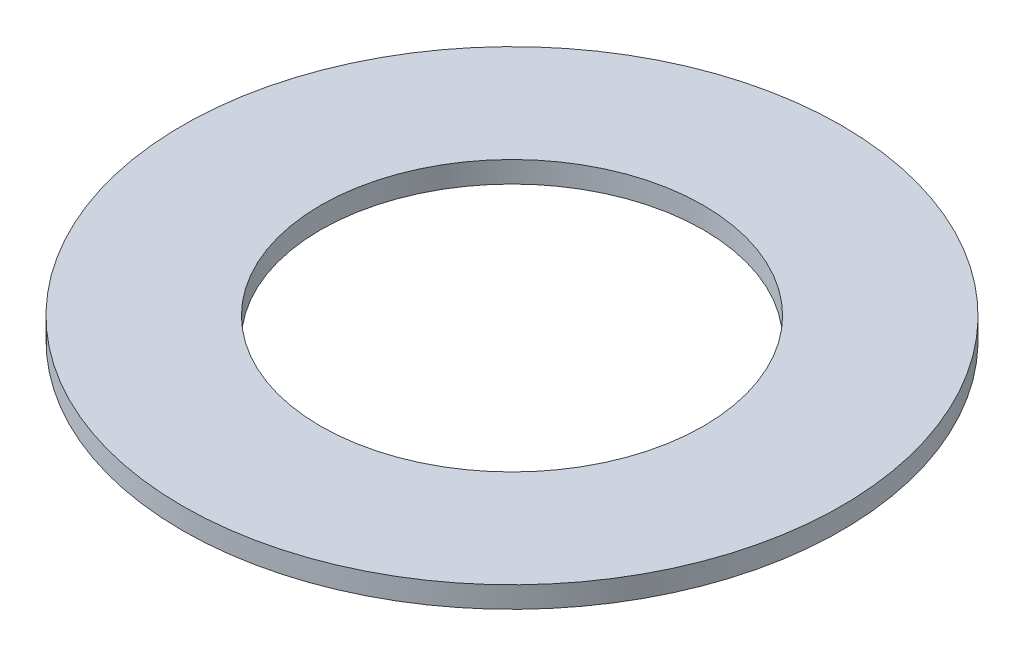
ISO-10303-21;
HEADER;
FILE_DESCRIPTION(('STEP AP214'),'2;1');
FILE_NAME('part.step','',(''),(''),'','','');
FILE_SCHEMA(('AUTOMOTIVE_DESIGN { 1 0 10303 214 1 1 1 1 }'));
ENDSEC;
DATA;
#1=APPLICATION_CONTEXT('core data for automotive mechanical design processes');
#2=APPLICATION_PROTOCOL_DEFINITION('international standard','automotive_design',2000,#1);
#3=PRODUCT_CONTEXT('',#1,'mechanical');
#4=PRODUCT('Part','Part','',(#3));
#5=PRODUCT_RELATED_PRODUCT_CATEGORY('part','',(#4));
#6=PRODUCT_DEFINITION_FORMATION('','',#4);
#7=PRODUCT_DEFINITION_CONTEXT('part definition',#1,'design');
#8=PRODUCT_DEFINITION('design','',#6,#7);
#9=PRODUCT_DEFINITION_SHAPE('','',#8);
#10=(LENGTH_UNIT() NAMED_UNIT(*) SI_UNIT(.MILLI.,.METRE.));
#11=(NAMED_UNIT(*) PLANE_ANGLE_UNIT() SI_UNIT($,.RADIAN.));
#12=(NAMED_UNIT(*) SI_UNIT($,.STERADIAN.) SOLID_ANGLE_UNIT());
#13=UNCERTAINTY_MEASURE_WITH_UNIT(LENGTH_MEASURE(1.E-05),#10,'distance_accuracy_value','');
#14=(GEOMETRIC_REPRESENTATION_CONTEXT(3) GLOBAL_UNCERTAINTY_ASSIGNED_CONTEXT((#13)) GLOBAL_UNIT_ASSIGNED_CONTEXT((#10,
#11,#12)) REPRESENTATION_CONTEXT('',''));
#15=CARTESIAN_POINT('',(0.,0.,0.));
#16=DIRECTION('',(0.,0.,1.));
#17=DIRECTION('',(1.,0.,0.));
#18=AXIS2_PLACEMENT_3D('',#15,#16,#17);
#19=CARTESIAN_POINT('',(8.88178419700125E-13,14.8699013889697,-4.44089209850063E-13));
#20=DIRECTION('',(0.,0.999999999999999,0.));
#21=DIRECTION('',(0.,0.,1.));
#22=AXIS2_PLACEMENT_3D('',#19,#20,#21);
#23=CYLINDRICAL_SURFACE('',#22,2.286);
#24=CARTESIAN_POINT('',(-1.77635683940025E-12,-0.127000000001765,8.88178419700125E-13));
#25=DIRECTION('',(0.,0.999999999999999,0.));
#26=DIRECTION('',(0.,0.,1.));
#27=AXIS2_PLACEMENT_3D('',#24,#25,#26);
#28=CIRCLE('',#27,2.286);
#29=CARTESIAN_POINT('',(8.77259703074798E-13,-0.127000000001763,2.28599999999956));
#30=VERTEX_POINT('',#29);
#31=EDGE_CURVE('E10',#30,#30,#28,.T.);
#32=CARTESIAN_POINT('',(8.88178419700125E-13,0.127000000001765,-8.88178419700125E-13));
#33=DIRECTION('',(0.,0.999999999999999,0.));
#34=DIRECTION('',(0.,0.,1.));
#35=AXIS2_PLACEMENT_3D('',#32,#33,#34);
#36=CIRCLE('',#35,2.286);
#37=CARTESIAN_POINT('',(8.77386601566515E-13,0.127000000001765,2.28599999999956));
#38=VERTEX_POINT('',#37);
#39=EDGE_CURVE('E46',#38,#38,#36,.T.);
#40=CARTESIAN_POINT('',(8.77259703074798E-13,-0.127000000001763,2.28599999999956));
#41=CARTESIAN_POINT('',(8.77261024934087E-13,-0.124354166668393,2.28599999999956));
#42=CARTESIAN_POINT('',(8.77262346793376E-13,-0.121708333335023,2.28599999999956));
#43=CARTESIAN_POINT('',(8.77264990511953E-13,-0.116416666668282,2.28599999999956));
#44=CARTESIAN_POINT('',(8.77266312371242E-13,-0.113770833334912,2.28599999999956));
#45=CARTESIAN_POINT('',(8.77268956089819E-13,-0.108479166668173,2.28599999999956));
#46=CARTESIAN_POINT('',(8.77270277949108E-13,-0.105833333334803,2.28599999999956));
#47=CARTESIAN_POINT('',(8.77272921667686E-13,-0.100541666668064,2.28599999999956));
#48=CARTESIAN_POINT('',(8.77274243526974E-13,-0.0978958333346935,2.28599999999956));
#49=CARTESIAN_POINT('',(8.77276887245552E-13,-0.0926041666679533,2.28599999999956));
#50=CARTESIAN_POINT('',(8.7727820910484E-13,-0.0899583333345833,2.28599999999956));
#51=CARTESIAN_POINT('',(8.77280852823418E-13,-0.0846666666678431,2.28599999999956));
#52=CARTESIAN_POINT('',(8.77282174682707E-13,-0.082020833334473,2.28599999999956));
#53=CARTESIAN_POINT('',(8.77284818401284E-13,-0.0767291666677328,2.28599999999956));
#54=CARTESIAN_POINT('',(8.77286140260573E-13,-0.0740833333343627,2.28599999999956));
#55=CARTESIAN_POINT('',(8.7728878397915E-13,-0.0687916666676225,2.28599999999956));
#56=CARTESIAN_POINT('',(8.77290105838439E-13,-0.0661458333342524,2.28599999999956));
#57=CARTESIAN_POINT('',(8.77292749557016E-13,-0.0608541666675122,2.28599999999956));
#58=CARTESIAN_POINT('',(8.77294071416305E-13,-0.0582083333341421,2.28599999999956));
#59=CARTESIAN_POINT('',(8.77296715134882E-13,-0.0529166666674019,2.28599999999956));
#60=CARTESIAN_POINT('',(8.77298036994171E-13,-0.0502708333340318,2.28599999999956));
#61=CARTESIAN_POINT('',(8.77300680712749E-13,-0.0449791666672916,2.28599999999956));
#62=CARTESIAN_POINT('',(8.77302002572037E-13,-0.0423333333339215,2.28599999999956));
#63=CARTESIAN_POINT('',(8.77304646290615E-13,-0.0370416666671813,2.28599999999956));
#64=CARTESIAN_POINT('',(8.77305968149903E-13,-0.0343958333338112,2.28599999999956));
#65=CARTESIAN_POINT('',(8.77308611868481E-13,-0.0291041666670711,2.28599999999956));
#66=CARTESIAN_POINT('',(8.7730993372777E-13,-0.026458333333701,2.28599999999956));
#67=CARTESIAN_POINT('',(8.77312577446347E-13,-0.0211666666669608,2.28599999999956));
#68=CARTESIAN_POINT('',(8.77313899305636E-13,-0.0185208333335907,2.28599999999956));
#69=CARTESIAN_POINT('',(8.77316543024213E-13,-0.0132291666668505,2.28599999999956));
#70=CARTESIAN_POINT('',(8.77317864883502E-13,-0.0105833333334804,2.28599999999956));
#71=CARTESIAN_POINT('',(8.77320508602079E-13,-0.00529166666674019,2.28599999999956));
#72=CARTESIAN_POINT('',(8.77321830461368E-13,-0.0026458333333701,2.28599999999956));
#73=CARTESIAN_POINT('',(8.77324474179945E-13,0.0026458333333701,2.28599999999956));
#74=CARTESIAN_POINT('',(8.77325796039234E-13,0.00529166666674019,2.28599999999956));
#75=CARTESIAN_POINT('',(8.77328439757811E-13,0.0105833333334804,2.28599999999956));
#76=CARTESIAN_POINT('',(8.773297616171E-13,0.0132291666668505,2.28599999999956));
#77=CARTESIAN_POINT('',(8.77332405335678E-13,0.0185208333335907,2.28599999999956));
#78=CARTESIAN_POINT('',(8.77333727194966E-13,0.0211666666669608,2.28599999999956));
#79=CARTESIAN_POINT('',(8.77336370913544E-13,0.026458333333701,2.28599999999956));
#80=CARTESIAN_POINT('',(8.77337692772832E-13,0.0291041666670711,2.28599999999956));
#81=CARTESIAN_POINT('',(8.7734033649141E-13,0.0343958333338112,2.28599999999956));
#82=CARTESIAN_POINT('',(8.77341658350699E-13,0.0370416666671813,2.28599999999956));
#83=CARTESIAN_POINT('',(8.77344302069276E-13,0.0423333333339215,2.28599999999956));
#84=CARTESIAN_POINT('',(8.77345623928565E-13,0.0449791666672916,2.28599999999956));
#85=CARTESIAN_POINT('',(8.77348267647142E-13,0.0502708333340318,2.28599999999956));
#86=CARTESIAN_POINT('',(8.77349589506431E-13,0.0529166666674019,2.28599999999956));
#87=CARTESIAN_POINT('',(8.77352233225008E-13,0.0582083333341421,2.28599999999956));
#88=CARTESIAN_POINT('',(8.77353555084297E-13,0.0608541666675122,2.28599999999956));
#89=CARTESIAN_POINT('',(8.77356198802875E-13,0.0661458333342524,2.28599999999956));
#90=CARTESIAN_POINT('',(8.77357520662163E-13,0.0687916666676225,2.28599999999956));
#91=CARTESIAN_POINT('',(8.77360164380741E-13,0.0740833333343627,2.28599999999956));
#92=CARTESIAN_POINT('',(8.77361486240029E-13,0.0767291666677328,2.28599999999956));
#93=CARTESIAN_POINT('',(8.77364129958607E-13,0.082020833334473,2.28599999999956));
#94=CARTESIAN_POINT('',(8.77365451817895E-13,0.0846666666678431,2.28599999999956));
#95=CARTESIAN_POINT('',(8.77368095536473E-13,0.0899583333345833,2.28599999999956));
#96=CARTESIAN_POINT('',(8.77369417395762E-13,0.0926041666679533,2.28599999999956));
#97=CARTESIAN_POINT('',(8.77372061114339E-13,0.0978958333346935,2.28599999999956));
#98=CARTESIAN_POINT('',(8.77373382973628E-13,0.100541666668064,2.28599999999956));
#99=CARTESIAN_POINT('',(8.77376026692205E-13,0.105833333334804,2.28599999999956));
#100=CARTESIAN_POINT('',(8.77377348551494E-13,0.108479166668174,2.28599999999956));
#101=CARTESIAN_POINT('',(8.77379992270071E-13,0.113770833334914,2.28599999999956));
#102=CARTESIAN_POINT('',(8.7738131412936E-13,0.116416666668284,2.28599999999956));
#103=CARTESIAN_POINT('',(8.77383957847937E-13,0.121708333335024,2.28599999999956));
#104=CARTESIAN_POINT('',(8.77385279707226E-13,0.124354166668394,2.28599999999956));
#105=CARTESIAN_POINT('',(8.77386601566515E-13,0.127000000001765,2.28599999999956));
#106=B_SPLINE_CURVE_WITH_KNOTS('',3,(#40,#41,#42,#43,#44,#45,#46,#47,#48,#49,#50,#51,#52,#53,
#54,#55,#56,#57,#58,#59,#60,#61,#62,#63,#64,#65,#66,#67,#68,#69,#70,#71,#72,#73,#74,#75,#76,#77,
#78,#79,#80,#81,#82,#83,#84,#85,#86,#87,#88,#89,#90,#91,#92,#93,#94,#95,#96,#97,#98,#99,#100,
#101,#102,#103,#104,#105),.UNSPECIFIED.,.F.,.F.,(4,2,2,2,2,2,2,2,2,2,2,2,2,2,2,2,2,2,2,2,2,2,2,
2,2,2,2,2,2,2,2,2,4),(0.,0.00793750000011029,0.0158750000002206,0.0238125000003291,
0.0317500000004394,0.0396875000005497,0.04762500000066,0.0555625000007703,0.0635000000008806,
0.0714375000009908,0.0793750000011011,0.0873125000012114,0.0952500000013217,0.103187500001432,
0.111125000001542,0.119062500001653,0.127000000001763,0.134937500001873,0.142875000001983,
0.150812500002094,0.158750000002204,0.166687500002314,0.174625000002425,0.182562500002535,
0.190500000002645,0.198437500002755,0.206375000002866,0.214312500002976,0.222250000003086,
0.230187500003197,0.238125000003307,0.246062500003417,0.254000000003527),.UNSPECIFIED.);
#107=EDGE_CURVE('BSEAM32',#30,#38,#106,.T.);
#108=ORIENTED_EDGE('',*,*,#31,.F.);
#109=ORIENTED_EDGE('',*,*,#39,.T.);
#110=ORIENTED_EDGE('',*,*,#107,.T.);
#111=ORIENTED_EDGE('',*,*,#107,.F.);
#112=EDGE_LOOP('',(#108,#110,#109,#111));
#113=FACE_BOUND('',#112,.T.);
#114=ADVANCED_FACE('F32',(#113),#23,.F.);
#115=CARTESIAN_POINT('',(2.66453525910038E-12,-0.1269999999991,-3.93700000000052));
#116=DIRECTION('',(0.,0.999999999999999,0.));
#117=DIRECTION('',(0.,0.,1.));
#118=AXIS2_PLACEMENT_3D('',#115,#116,#117);
#119=PLANE('',#118);
#120=CARTESIAN_POINT('',(-1.77635683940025E-12,-0.127000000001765,8.88178419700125E-13));
#121=DIRECTION('',(0.,0.999999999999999,0.));
#122=DIRECTION('',(0.,0.,1.));
#123=AXIS2_PLACEMENT_3D('',#120,#121,#122);
#124=CIRCLE('',#123,3.937);
#125=CARTESIAN_POINT('',(8.74785182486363E-13,-0.127000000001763,3.93699999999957));
#126=VERTEX_POINT('',#125);
#127=EDGE_CURVE('E38',#126,#126,#124,.T.);
#128=ORIENTED_EDGE('',*,*,#127,.F.);
#129=EDGE_LOOP('',(#128));
#130=FACE_BOUND('',#129,.T.);
#131=ORIENTED_EDGE('',*,*,#31,.T.);
#132=EDGE_LOOP('',(#131));
#133=FACE_BOUND('',#132,.T.);
#134=ADVANCED_FACE('F61',(#130,#133),#119,.F.);
#135=CARTESIAN_POINT('',(8.88178419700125E-13,14.8699013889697,-4.44089209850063E-13));
#136=DIRECTION('',(0.,0.999999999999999,0.));
#137=DIRECTION('',(0.,0.,1.));
#138=AXIS2_PLACEMENT_3D('',#135,#136,#137);
#139=CYLINDRICAL_SURFACE('',#138,3.937);
#140=CARTESIAN_POINT('',(8.88178419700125E-13,0.127000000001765,-8.88178419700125E-13));
#141=DIRECTION('',(0.,0.999999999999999,0.));
#142=DIRECTION('',(0.,0.,1.));
#143=AXIS2_PLACEMENT_3D('',#140,#141,#142);
#144=CIRCLE('',#143,3.937);
#145=CARTESIAN_POINT('',(8.74912080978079E-13,0.127000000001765,3.93699999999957));
#146=VERTEX_POINT('',#145);
#147=EDGE_CURVE('E42',#146,#146,#144,.T.);
#148=CARTESIAN_POINT('',(8.74912080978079E-13,0.127000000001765,3.93699999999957));
#149=CARTESIAN_POINT('',(8.7491075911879E-13,0.124354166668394,3.93699999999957));
#150=CARTESIAN_POINT('',(8.74909437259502E-13,0.121708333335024,3.93699999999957));
#151=CARTESIAN_POINT('',(8.74906793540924E-13,0.116416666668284,3.93699999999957));
#152=CARTESIAN_POINT('',(8.74905471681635E-13,0.113770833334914,3.93699999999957));
#153=CARTESIAN_POINT('',(8.74902827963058E-13,0.108479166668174,3.93699999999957));
#154=CARTESIAN_POINT('',(8.74901506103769E-13,0.105833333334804,3.93699999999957));
#155=CARTESIAN_POINT('',(8.74898862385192E-13,0.100541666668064,3.93699999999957));
#156=CARTESIAN_POINT('',(8.74897540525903E-13,0.0978958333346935,3.93699999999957));
#157=CARTESIAN_POINT('',(8.74894896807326E-13,0.0926041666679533,3.93699999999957));
#158=CARTESIAN_POINT('',(8.74893574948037E-13,0.0899583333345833,3.93699999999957));
#159=CARTESIAN_POINT('',(8.7489093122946E-13,0.0846666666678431,3.93699999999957));
#160=CARTESIAN_POINT('',(8.74889609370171E-13,0.082020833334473,3.93699999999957));
#161=CARTESIAN_POINT('',(8.74886965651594E-13,0.0767291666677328,3.93699999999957));
#162=CARTESIAN_POINT('',(8.74885643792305E-13,0.0740833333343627,3.93699999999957));
#163=CARTESIAN_POINT('',(8.74883000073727E-13,0.0687916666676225,3.93699999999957));
#164=CARTESIAN_POINT('',(8.74881678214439E-13,0.0661458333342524,3.93699999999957));
#165=CARTESIAN_POINT('',(8.74879034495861E-13,0.0608541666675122,3.93699999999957));
#166=CARTESIAN_POINT('',(8.74877712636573E-13,0.0582083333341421,3.93699999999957));
#167=CARTESIAN_POINT('',(8.74875068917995E-13,0.0529166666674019,3.93699999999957));
#168=CARTESIAN_POINT('',(8.74873747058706E-13,0.0502708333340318,3.93699999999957));
#169=CARTESIAN_POINT('',(8.74871103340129E-13,0.0449791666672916,3.93699999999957));
#170=CARTESIAN_POINT('',(8.7486978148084E-13,0.0423333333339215,3.93699999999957));
#171=CARTESIAN_POINT('',(8.74867137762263E-13,0.0370416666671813,3.93699999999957));
#172=CARTESIAN_POINT('',(8.74865815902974E-13,0.0343958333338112,3.93699999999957));
#173=CARTESIAN_POINT('',(8.74863172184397E-13,0.0291041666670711,3.93699999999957));
#174=CARTESIAN_POINT('',(8.74861850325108E-13,0.026458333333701,3.93699999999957));
#175=CARTESIAN_POINT('',(8.74859206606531E-13,0.0211666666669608,3.93699999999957));
#176=CARTESIAN_POINT('',(8.74857884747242E-13,0.0185208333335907,3.93699999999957));
#177=CARTESIAN_POINT('',(8.74855241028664E-13,0.0132291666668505,3.93699999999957));
#178=CARTESIAN_POINT('',(8.74853919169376E-13,0.0105833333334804,3.93699999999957));
#179=CARTESIAN_POINT('',(8.74851275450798E-13,0.00529166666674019,3.93699999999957));
#180=CARTESIAN_POINT('',(8.7484995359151E-13,0.0026458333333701,3.93699999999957));
#181=CARTESIAN_POINT('',(8.74847309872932E-13,-0.0026458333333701,3.93699999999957));
#182=CARTESIAN_POINT('',(8.74845988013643E-13,-0.00529166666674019,3.93699999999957));
#183=CARTESIAN_POINT('',(8.74843344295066E-13,-0.0105833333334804,3.93699999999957));
#184=CARTESIAN_POINT('',(8.74842022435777E-13,-0.0132291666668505,3.93699999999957));
#185=CARTESIAN_POINT('',(8.748393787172E-13,-0.0185208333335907,3.93699999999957));
#186=CARTESIAN_POINT('',(8.74838056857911E-13,-0.0211666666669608,3.93699999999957));
#187=CARTESIAN_POINT('',(8.74835413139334E-13,-0.026458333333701,3.93699999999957));
#188=CARTESIAN_POINT('',(8.74834091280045E-13,-0.0291041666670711,3.93699999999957));
#189=CARTESIAN_POINT('',(8.74831447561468E-13,-0.0343958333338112,3.93699999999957));
#190=CARTESIAN_POINT('',(8.74830125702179E-13,-0.0370416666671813,3.93699999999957));
#191=CARTESIAN_POINT('',(8.74827481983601E-13,-0.0423333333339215,3.93699999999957));
#192=CARTESIAN_POINT('',(8.74826160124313E-13,-0.0449791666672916,3.93699999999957));
#193=CARTESIAN_POINT('',(8.74823516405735E-13,-0.0502708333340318,3.93699999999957));
#194=CARTESIAN_POINT('',(8.74822194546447E-13,-0.0529166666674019,3.93699999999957));
#195=CARTESIAN_POINT('',(8.74819550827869E-13,-0.0582083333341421,3.93699999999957));
#196=CARTESIAN_POINT('',(8.7481822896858E-13,-0.0608541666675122,3.93699999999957));
#197=CARTESIAN_POINT('',(8.74815585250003E-13,-0.0661458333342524,3.93699999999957));
#198=CARTESIAN_POINT('',(8.74814263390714E-13,-0.0687916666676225,3.93699999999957));
#199=CARTESIAN_POINT('',(8.74811619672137E-13,-0.0740833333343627,3.93699999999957));
#200=CARTESIAN_POINT('',(8.74810297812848E-13,-0.0767291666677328,3.93699999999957));
#201=CARTESIAN_POINT('',(8.74807654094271E-13,-0.082020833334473,3.93699999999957));
#202=CARTESIAN_POINT('',(8.74806332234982E-13,-0.0846666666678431,3.93699999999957));
#203=CARTESIAN_POINT('',(8.74803688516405E-13,-0.0899583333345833,3.93699999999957));
#204=CARTESIAN_POINT('',(8.74802366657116E-13,-0.0926041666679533,3.93699999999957));
#205=CARTESIAN_POINT('',(8.74799722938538E-13,-0.0978958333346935,3.93699999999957));
#206=CARTESIAN_POINT('',(8.7479840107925E-13,-0.100541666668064,3.93699999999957));
#207=CARTESIAN_POINT('',(8.74795757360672E-13,-0.105833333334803,3.93699999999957));
#208=CARTESIAN_POINT('',(8.74794435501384E-13,-0.108479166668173,3.93699999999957));
#209=CARTESIAN_POINT('',(8.74791791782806E-13,-0.113770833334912,3.93699999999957));
#210=CARTESIAN_POINT('',(8.74790469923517E-13,-0.116416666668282,3.93699999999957));
#211=CARTESIAN_POINT('',(8.7478782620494E-13,-0.121708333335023,3.93699999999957));
#212=CARTESIAN_POINT('',(8.74786504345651E-13,-0.124354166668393,3.93699999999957));
#213=CARTESIAN_POINT('',(8.74785182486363E-13,-0.127000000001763,3.93699999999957));
#214=B_SPLINE_CURVE_WITH_KNOTS('',3,(#148,#149,#150,#151,#152,#153,#154,#155,#156,#157,#158,
#159,#160,#161,#162,#163,#164,#165,#166,#167,#168,#169,#170,#171,#172,#173,#174,#175,#176,#177,
#178,#179,#180,#181,#182,#183,#184,#185,#186,#187,#188,#189,#190,#191,#192,#193,#194,#195,#196,
#197,#198,#199,#200,#201,#202,#203,#204,#205,#206,#207,#208,#209,#210,#211,#212,#213),
.UNSPECIFIED.,.F.,.F.,(4,2,2,2,2,2,2,2,2,2,2,2,2,2,2,2,2,2,2,2,2,2,2,2,2,2,2,2,2,2,2,2,4),(0.,
0.00793750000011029,0.0158750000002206,0.0238125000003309,0.0317500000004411,0.0396875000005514,
0.0476250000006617,0.055562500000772,0.0635000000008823,0.0714375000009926,0.0793750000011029,
0.0873125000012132,0.0952500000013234,0.103187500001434,0.111125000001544,0.119062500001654,
0.127000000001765,0.134937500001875,0.142875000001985,0.150812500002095,0.158750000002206,
0.166687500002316,0.174625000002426,0.182562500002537,0.190500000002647,0.198437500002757,
0.206375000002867,0.214312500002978,0.222250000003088,0.230187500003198,0.238125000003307,
0.246062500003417,0.254000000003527),.UNSPECIFIED.);
#215=EDGE_CURVE('BSEAM56',#146,#126,#214,.T.);
#216=ORIENTED_EDGE('',*,*,#147,.F.);
#217=ORIENTED_EDGE('',*,*,#127,.T.);
#218=ORIENTED_EDGE('',*,*,#215,.T.);
#219=ORIENTED_EDGE('',*,*,#215,.F.);
#220=EDGE_LOOP('',(#216,#218,#217,#219));
#221=FACE_BOUND('',#220,.T.);
#222=ADVANCED_FACE('F56',(#221),#139,.T.);
#223=CARTESIAN_POINT('',(8.88178419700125E-13,0.127000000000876,-3.93699999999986));
#224=DIRECTION('',(0.,-0.999999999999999,0.));
#225=DIRECTION('',(0.,0.,-1.));
#226=AXIS2_PLACEMENT_3D('',#223,#224,#225);
#227=PLANE('',#226);
#228=ORIENTED_EDGE('',*,*,#39,.F.);
#229=EDGE_LOOP('',(#228));
#230=FACE_BOUND('',#229,.T.);
#231=ORIENTED_EDGE('',*,*,#147,.T.);
#232=EDGE_LOOP('',(#231));
#233=FACE_BOUND('',#232,.T.);
#234=ADVANCED_FACE('F53',(#230,#233),#227,.F.);
#235=CLOSED_SHELL('',(#114,#134,#222,#234));
#236=MANIFOLD_SOLID_BREP('B2',#235);
#237=ADVANCED_BREP_SHAPE_REPRESENTATION('',(#18,#236),#14);
#238=SHAPE_DEFINITION_REPRESENTATION(#9,#237);
ENDSEC;
END-ISO-10303-21;
